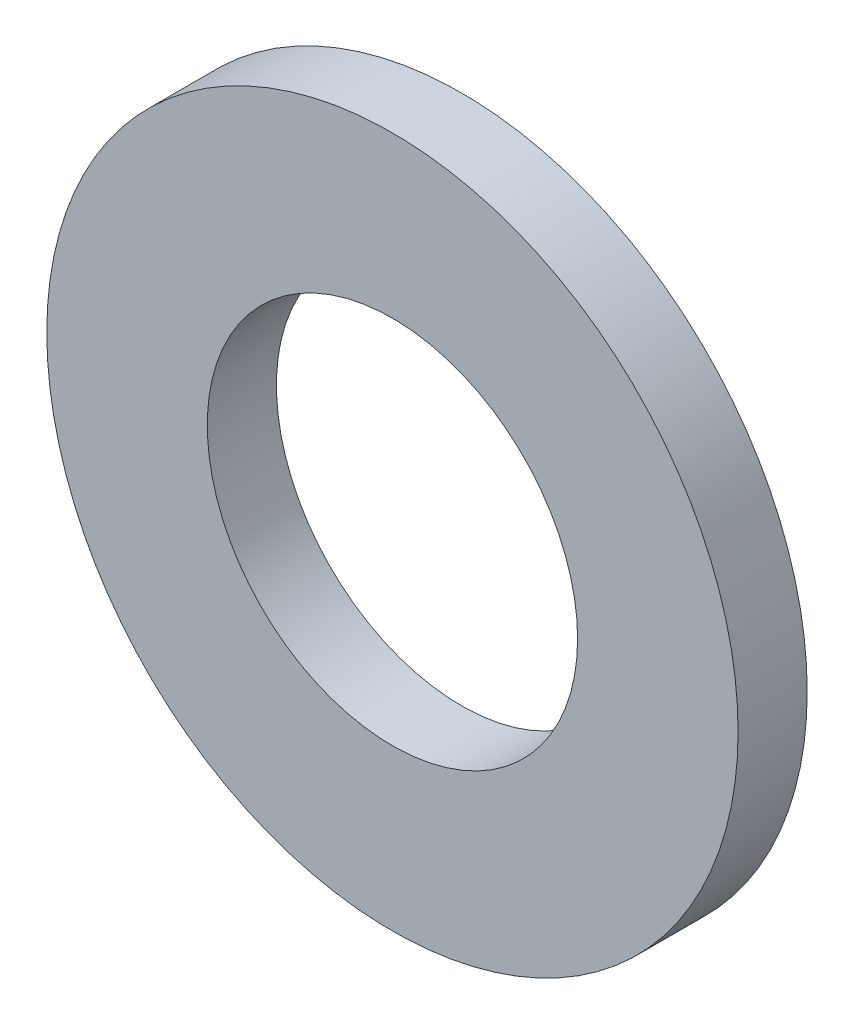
from build123d import *

# Parameters (mm, degrees)
ESQUISSE1_R          = 14
ESQUISSE1_R_2        = 7.5
BASE_EXTRUSION_DEPTH = 2.8


with BuildPart() as part:
    # Esquisse1 → Base-Extrusion (new body)
    with BuildSketch(Plane.XY):
        Circle(ESQUISSE1_R)
        Circle(ESQUISSE1_R_2, mode=Mode.SUBTRACT)
    extrude(amount=-BASE_EXTRUSION_DEPTH)


solid = part.part
